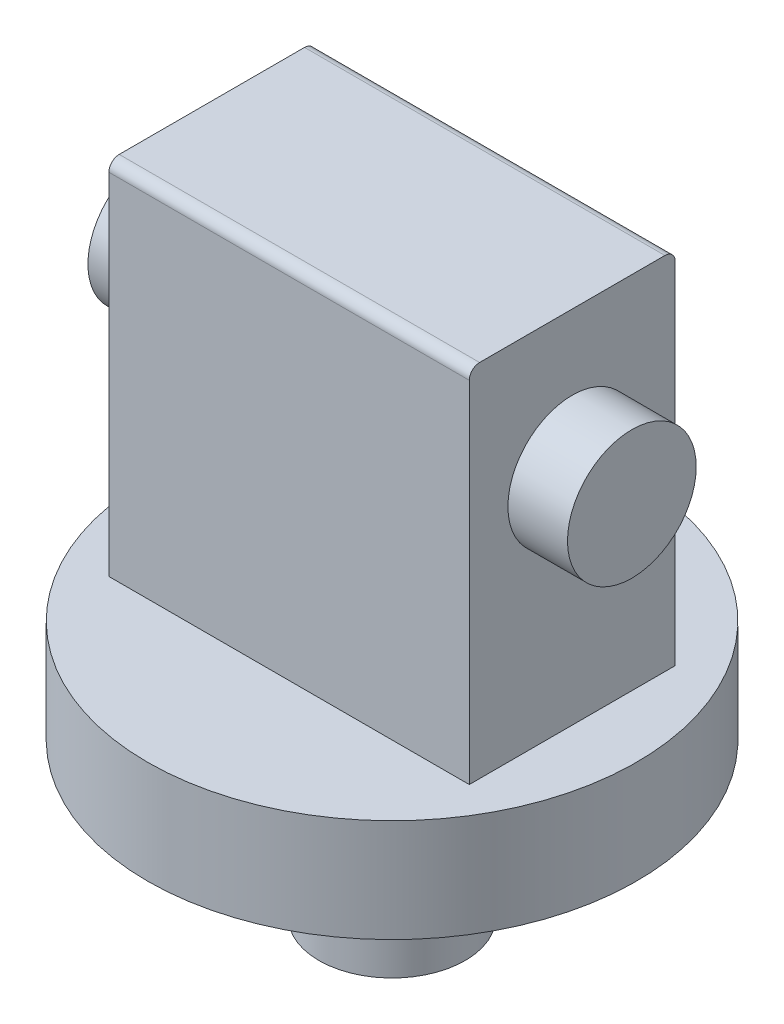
from build123d import *

# Parameters (mm, degrees)
SKETCH1_R           = 60.325
BOSS_EXTRUDE1_DEPTH = 25.4
SKETCH4_W           = 88.9
SKETCH4_H           = 50.8
BOSS_EXTRUDE2_DEPTH = 88.9
SKETCH6_R           = 15.875
BOSS_EXTRUDE3_DEPTH = 14.7
SKETCH7_R           = 18.05
BOSS_EXTRUDE4_DEPTH = 38.1
FILLET1_R           = 2.54


with BuildPart() as part:
    # Sketch1 → Boss-Extrude1 (new body)
    with BuildSketch(Plane(origin=(0, 0, 0), x_dir=(1, 0, 0), z_dir=(0, 1, 0))):
        with Locations(Location((0, 0, 0), (0, 0, 270))):
            Circle(SKETCH1_R)
    extrude(amount=BOSS_EXTRUDE1_DEPTH)

    # Sketch4 → Boss-Extrude2 (add)
    with BuildSketch(Plane(origin=(0, 25.4, 0), x_dir=(1, 0, 0), z_dir=(0, 1, 0))):
        Rectangle(SKETCH4_W, SKETCH4_H)
    extrude(amount=BOSS_EXTRUDE2_DEPTH)

    # Sketch6 → Boss-Extrude3 (add)
    with BuildSketch(Plane(origin=(44.45, 0, 0), x_dir=(0, 0, -1), z_dir=(1, 0, 0))):
        with Locations(Location((0, 80.01, 0), (0, 0, 180))):
            Circle(SKETCH6_R)
    boss_extrude3 = extrude(amount=BOSS_EXTRUDE3_DEPTH)

    # Mirror1: Boss-Extrude3 across plane
    add(boss_extrude3.mirror(Plane(origin=(0, 0, 0), x_dir=(0, 0, 1), z_dir=(1, 0, 0))))

    # Sketch7 → Boss-Extrude4 (add)
    with BuildSketch(Plane.XZ):
        with Locations(Location((0, 0, 0), (0, 0, 90))):
            Circle(SKETCH7_R)
    extrude(amount=BOSS_EXTRUDE4_DEPTH)

    # Fillet1
    fillet1_edges = [part.edges().sort_by_distance(p)[0] for p in [
        (0, 114.3, 25.4),
        (0, 114.3, -25.4),
    ]]
    fillet(fillet1_edges, radius=FILLET1_R)


solid = part.part
